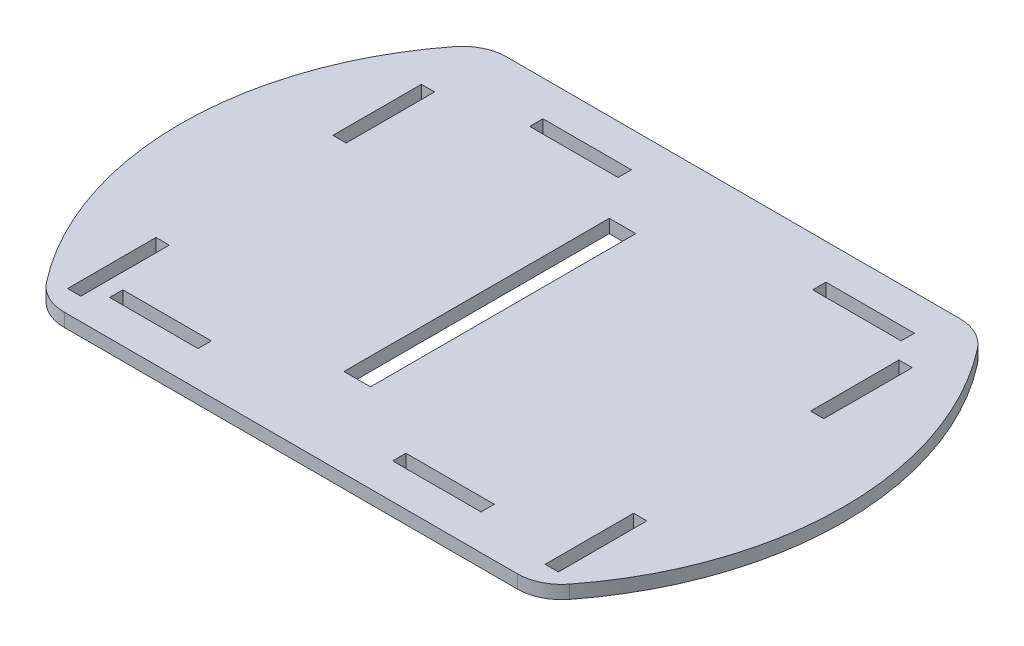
ISO-10303-21;
HEADER;
FILE_DESCRIPTION(('STEP AP214'),'2;1');
FILE_NAME('part.step','',(''),(''),'','','');
FILE_SCHEMA(('AUTOMOTIVE_DESIGN { 1 0 10303 214 1 1 1 1 }'));
ENDSEC;
DATA;
#1=APPLICATION_CONTEXT('core data for automotive mechanical design processes');
#2=APPLICATION_PROTOCOL_DEFINITION('international standard','automotive_design',2000,#1);
#3=PRODUCT_CONTEXT('',#1,'mechanical');
#4=PRODUCT('Part','Part','',(#3));
#5=PRODUCT_RELATED_PRODUCT_CATEGORY('part','',(#4));
#6=PRODUCT_DEFINITION_FORMATION('','',#4);
#7=PRODUCT_DEFINITION_CONTEXT('part definition',#1,'design');
#8=PRODUCT_DEFINITION('design','',#6,#7);
#9=PRODUCT_DEFINITION_SHAPE('','',#8);
#10=(LENGTH_UNIT() NAMED_UNIT(*) SI_UNIT(.MILLI.,.METRE.));
#11=(NAMED_UNIT(*) PLANE_ANGLE_UNIT() SI_UNIT($,.RADIAN.));
#12=(NAMED_UNIT(*) SI_UNIT($,.STERADIAN.) SOLID_ANGLE_UNIT());
#13=UNCERTAINTY_MEASURE_WITH_UNIT(LENGTH_MEASURE(1.E-05),#10,'distance_accuracy_value','');
#14=(GEOMETRIC_REPRESENTATION_CONTEXT(3) GLOBAL_UNCERTAINTY_ASSIGNED_CONTEXT((#13)) GLOBAL_UNIT_ASSIGNED_CONTEXT((#10,
#11,#12)) REPRESENTATION_CONTEXT('',''));
#15=CARTESIAN_POINT('',(0.,0.,0.));
#16=DIRECTION('',(0.,0.,1.));
#17=DIRECTION('',(1.,0.,0.));
#18=AXIS2_PLACEMENT_3D('',#15,#16,#17);
#19=CARTESIAN_POINT('',(0.,3.,0.));
#20=DIRECTION('',(0.,-1.,0.));
#21=DIRECTION('',(0.,0.,-1.));
#22=AXIS2_PLACEMENT_3D('',#19,#20,#21);
#23=CYLINDRICAL_SURFACE('',#22,75.);
#24=CARTESIAN_POINT('',(0.,3.,0.));
#25=DIRECTION('',(0.,1.,0.));
#26=DIRECTION('',(0.,0.,1.));
#27=AXIS2_PLACEMENT_3D('',#24,#25,#26);
#28=CIRCLE('',#27,75.);
#29=CARTESIAN_POINT('',(-59.1170236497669,3.,-46.1538461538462));
#30=VERTEX_POINT('',#29);
#31=CARTESIAN_POINT('',(-59.1170236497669,3.,46.1538461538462));
#32=VERTEX_POINT('',#31);
#33=EDGE_CURVE('E581',#30,#32,#28,.T.);
#34=ORIENTED_EDGE('',*,*,#33,.F.);
#35=DIRECTION('',(0.,-1.,0.));
#36=VECTOR('',#35,1.);
#37=CARTESIAN_POINT('',(-59.1170236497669,3.,-46.1538461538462));
#38=LINE('',#37,#36);
#39=CARTESIAN_POINT('',(-59.1170236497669,0.,-46.1538461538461));
#40=VERTEX_POINT('',#39);
#41=EDGE_CURVE('E634',#30,#40,#38,.T.);
#42=ORIENTED_EDGE('',*,*,#41,.T.);
#43=CARTESIAN_POINT('',(0.,0.,0.));
#44=DIRECTION('',(0.,1.,0.));
#45=DIRECTION('',(0.,0.,1.));
#46=AXIS2_PLACEMENT_3D('',#43,#44,#45);
#47=CIRCLE('',#46,75.);
#48=CARTESIAN_POINT('',(-59.1170236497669,0.,46.1538461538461));
#49=VERTEX_POINT('',#48);
#50=EDGE_CURVE('E572',#40,#49,#47,.T.);
#51=ORIENTED_EDGE('',*,*,#50,.T.);
#52=DIRECTION('',(0.,-1.,0.));
#53=VECTOR('',#52,1.);
#54=CARTESIAN_POINT('',(-59.1170236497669,3.,46.1538461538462));
#55=LINE('',#54,#53);
#56=EDGE_CURVE('E631',#49,#32,#55,.F.);
#57=ORIENTED_EDGE('',*,*,#56,.T.);
#58=EDGE_LOOP('',(#34,#42,#51,#57));
#59=FACE_BOUND('',#58,.T.);
#60=ADVANCED_FACE('F38',(#59),#23,.T.);
#61=CARTESIAN_POINT('',(0.,3.,0.));
#62=DIRECTION('',(0.,-1.,0.));
#63=DIRECTION('',(0.,0.,-1.));
#64=AXIS2_PLACEMENT_3D('',#61,#62,#63);
#65=CYLINDRICAL_SURFACE('',#64,75.);
#66=CARTESIAN_POINT('',(0.,0.,0.));
#67=DIRECTION('',(0.,1.,0.));
#68=DIRECTION('',(0.,0.,1.));
#69=AXIS2_PLACEMENT_3D('',#66,#67,#68);
#70=CIRCLE('',#69,75.);
#71=CARTESIAN_POINT('',(59.1170236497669,0.,46.1538461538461));
#72=VERTEX_POINT('',#71);
#73=CARTESIAN_POINT('',(59.1170236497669,0.,-46.1538461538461));
#74=VERTEX_POINT('',#73);
#75=EDGE_CURVE('E582',#72,#74,#70,.T.);
#76=ORIENTED_EDGE('',*,*,#75,.T.);
#77=DIRECTION('',(0.,-1.,0.));
#78=VECTOR('',#77,1.);
#79=CARTESIAN_POINT('',(59.1170236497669,3.,-46.1538461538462));
#80=LINE('',#79,#78);
#81=CARTESIAN_POINT('',(59.1170236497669,3.,-46.1538461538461));
#82=VERTEX_POINT('',#81);
#83=EDGE_CURVE('E658',#74,#82,#80,.F.);
#84=ORIENTED_EDGE('',*,*,#83,.T.);
#85=CARTESIAN_POINT('',(0.,3.,0.));
#86=DIRECTION('',(0.,1.,0.));
#87=DIRECTION('',(0.,0.,-1.));
#88=AXIS2_PLACEMENT_3D('',#85,#86,#87);
#89=CIRCLE('',#88,75.);
#90=CARTESIAN_POINT('',(59.1170236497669,3.,46.1538461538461));
#91=VERTEX_POINT('',#90);
#92=EDGE_CURVE('E579',#91,#82,#89,.T.);
#93=ORIENTED_EDGE('',*,*,#92,.F.);
#94=DIRECTION('',(0.,-1.,0.));
#95=VECTOR('',#94,1.);
#96=CARTESIAN_POINT('',(59.1170236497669,3.,46.1538461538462));
#97=LINE('',#96,#95);
#98=EDGE_CURVE('E655',#91,#72,#97,.T.);
#99=ORIENTED_EDGE('',*,*,#98,.T.);
#100=EDGE_LOOP('',(#76,#84,#93,#99));
#101=FACE_BOUND('',#100,.T.);
#102=ADVANCED_FACE('F685',(#101),#65,.T.);
#103=CARTESIAN_POINT('',(0.,3.,0.));
#104=DIRECTION('',(0.,-1.,0.));
#105=DIRECTION('',(0.,0.,-1.));
#106=AXIS2_PLACEMENT_3D('',#103,#104,#105);
#107=PLANE('',#106);
#108=DIRECTION('',(-1.,0.,0.));
#109=VECTOR('',#108,1.);
#110=CARTESIAN_POINT('',(-2.,3.,-30.));
#111=LINE('',#110,#109);
#112=CARTESIAN_POINT('',(-2.,3.,-30.));
#113=VERTEX_POINT('',#112);
#114=CARTESIAN_POINT('',(-8.,3.,-30.));
#115=VERTEX_POINT('',#114);
#116=EDGE_CURVE('E355',#113,#115,#111,.T.);
#117=ORIENTED_EDGE('',*,*,#116,.F.);
#118=DIRECTION('',(0.,0.,-1.));
#119=VECTOR('',#118,1.);
#120=CARTESIAN_POINT('',(-2.,3.,-30.));
#121=LINE('',#120,#119);
#122=CARTESIAN_POINT('',(-2.,3.,30.));
#123=VERTEX_POINT('',#122);
#124=EDGE_CURVE('E328',#123,#113,#121,.T.);
#125=ORIENTED_EDGE('',*,*,#124,.F.);
#126=DIRECTION('',(1.,0.,0.));
#127=VECTOR('',#126,1.);
#128=CARTESIAN_POINT('',(-2.,3.,30.));
#129=LINE('',#128,#127);
#130=CARTESIAN_POINT('',(-8.,3.,30.));
#131=VERTEX_POINT('',#130);
#132=EDGE_CURVE('E346',#131,#123,#129,.T.);
#133=ORIENTED_EDGE('',*,*,#132,.F.);
#134=DIRECTION('',(0.,0.,1.));
#135=VECTOR('',#134,1.);
#136=CARTESIAN_POINT('',(-8.,3.,-30.));
#137=LINE('',#136,#135);
#138=EDGE_CURVE('E349',#115,#131,#137,.T.);
#139=ORIENTED_EDGE('',*,*,#138,.F.);
#140=EDGE_LOOP('',(#117,#125,#133,#139));
#141=FACE_BOUND('',#140,.T.);
#142=DIRECTION('',(1.,0.,0.));
#143=VECTOR('',#142,1.);
#144=CARTESIAN_POINT('',(15.,3.,42.));
#145=LINE('',#144,#143);
#146=CARTESIAN_POINT('',(15.,3.,42.));
#147=VERTEX_POINT('',#146);
#148=CARTESIAN_POINT('',(35.,3.,42.));
#149=VERTEX_POINT('',#148);
#150=EDGE_CURVE('E419',#147,#149,#145,.T.);
#151=ORIENTED_EDGE('',*,*,#150,.F.);
#152=DIRECTION('',(0.,0.,1.));
#153=VECTOR('',#152,1.);
#154=CARTESIAN_POINT('',(15.,3.,39.));
#155=LINE('',#154,#153);
#156=CARTESIAN_POINT('',(15.,3.,39.));
#157=VERTEX_POINT('',#156);
#158=EDGE_CURVE('E417',#157,#147,#155,.T.);
#159=ORIENTED_EDGE('',*,*,#158,.F.);
#160=DIRECTION('',(-1.,0.,0.));
#161=VECTOR('',#160,1.);
#162=CARTESIAN_POINT('',(15.,3.,39.));
#163=LINE('',#162,#161);
#164=CARTESIAN_POINT('',(35.,3.,39.));
#165=VERTEX_POINT('',#164);
#166=EDGE_CURVE('E407',#165,#157,#163,.T.);
#167=ORIENTED_EDGE('',*,*,#166,.F.);
#168=DIRECTION('',(0.,0.,-1.));
#169=VECTOR('',#168,1.);
#170=CARTESIAN_POINT('',(35.,3.,39.));
#171=LINE('',#170,#169);
#172=EDGE_CURVE('E423',#149,#165,#171,.T.);
#173=ORIENTED_EDGE('',*,*,#172,.F.);
#174=EDGE_LOOP('',(#151,#159,#167,#173));
#175=FACE_BOUND('',#174,.T.);
#176=DIRECTION('',(1.,0.,0.));
#177=VECTOR('',#176,1.);
#178=CARTESIAN_POINT('',(-35.,3.,-39.));
#179=LINE('',#178,#177);
#180=CARTESIAN_POINT('',(-35.,3.,-39.));
#181=VERTEX_POINT('',#180);
#182=CARTESIAN_POINT('',(-15.,3.,-39.));
#183=VERTEX_POINT('',#182);
#184=EDGE_CURVE('E452',#181,#183,#179,.T.);
#185=ORIENTED_EDGE('',*,*,#184,.F.);
#186=DIRECTION('',(0.,0.,1.));
#187=VECTOR('',#186,1.);
#188=CARTESIAN_POINT('',(-35.,3.,-42.));
#189=LINE('',#188,#187);
#190=CARTESIAN_POINT('',(-35.,3.,-42.));
#191=VERTEX_POINT('',#190);
#192=EDGE_CURVE('E396',#191,#181,#189,.T.);
#193=ORIENTED_EDGE('',*,*,#192,.F.);
#194=DIRECTION('',(-1.,0.,0.));
#195=VECTOR('',#194,1.);
#196=CARTESIAN_POINT('',(-35.,3.,-42.));
#197=LINE('',#196,#195);
#198=CARTESIAN_POINT('',(-15.,3.,-42.));
#199=VERTEX_POINT('',#198);
#200=EDGE_CURVE('E441',#199,#191,#197,.T.);
#201=ORIENTED_EDGE('',*,*,#200,.F.);
#202=DIRECTION('',(0.,0.,-1.));
#203=VECTOR('',#202,1.);
#204=CARTESIAN_POINT('',(-15.,3.,-42.));
#205=LINE('',#204,#203);
#206=EDGE_CURVE('E455',#183,#199,#205,.T.);
#207=ORIENTED_EDGE('',*,*,#206,.F.);
#208=EDGE_LOOP('',(#185,#193,#201,#207));
#209=FACE_BOUND('',#208,.T.);
#210=DIRECTION('',(1.,0.,0.));
#211=VECTOR('',#210,1.);
#212=CARTESIAN_POINT('',(29.,3.,-39.));
#213=LINE('',#212,#211);
#214=CARTESIAN_POINT('',(29.,3.,-39.));
#215=VERTEX_POINT('',#214);
#216=CARTESIAN_POINT('',(49.,3.,-39.));
#217=VERTEX_POINT('',#216);
#218=EDGE_CURVE('E386',#215,#217,#213,.T.);
#219=ORIENTED_EDGE('',*,*,#218,.F.);
#220=DIRECTION('',(0.,0.,1.));
#221=VECTOR('',#220,1.);
#222=CARTESIAN_POINT('',(29.,3.,-42.));
#223=LINE('',#222,#221);
#224=CARTESIAN_POINT('',(29.,3.,-42.));
#225=VERTEX_POINT('',#224);
#226=EDGE_CURVE('E368',#225,#215,#223,.T.);
#227=ORIENTED_EDGE('',*,*,#226,.F.);
#228=DIRECTION('',(-1.,0.,0.));
#229=VECTOR('',#228,1.);
#230=CARTESIAN_POINT('',(29.,3.,-42.));
#231=LINE('',#230,#229);
#232=CARTESIAN_POINT('',(49.,3.,-42.));
#233=VERTEX_POINT('',#232);
#234=EDGE_CURVE('E375',#233,#225,#231,.T.);
#235=ORIENTED_EDGE('',*,*,#234,.F.);
#236=DIRECTION('',(0.,0.,-1.));
#237=VECTOR('',#236,1.);
#238=CARTESIAN_POINT('',(49.,3.,-42.));
#239=LINE('',#238,#237);
#240=EDGE_CURVE('E389',#217,#233,#239,.T.);
#241=ORIENTED_EDGE('',*,*,#240,.F.);
#242=EDGE_LOOP('',(#219,#227,#235,#241));
#243=FACE_BOUND('',#242,.T.);
#244=DIRECTION('',(1.,0.,0.));
#245=VECTOR('',#244,1.);
#246=CARTESIAN_POINT('',(-49.,3.,42.));
#247=LINE('',#246,#245);
#248=CARTESIAN_POINT('',(-49.,3.,42.));
#249=VERTEX_POINT('',#248);
#250=CARTESIAN_POINT('',(-29.,3.,42.));
#251=VERTEX_POINT('',#250);
#252=EDGE_CURVE('E482',#249,#251,#247,.T.);
#253=ORIENTED_EDGE('',*,*,#252,.F.);
#254=DIRECTION('',(0.,0.,1.));
#255=VECTOR('',#254,1.);
#256=CARTESIAN_POINT('',(-49.,3.,39.));
#257=LINE('',#256,#255);
#258=CARTESIAN_POINT('',(-49.,3.,39.));
#259=VERTEX_POINT('',#258);
#260=EDGE_CURVE('E430',#259,#249,#257,.T.);
#261=ORIENTED_EDGE('',*,*,#260,.F.);
#262=DIRECTION('',(-1.,0.,0.));
#263=VECTOR('',#262,1.);
#264=CARTESIAN_POINT('',(-49.,3.,39.));
#265=LINE('',#264,#263);
#266=CARTESIAN_POINT('',(-29.,3.,39.));
#267=VERTEX_POINT('',#266);
#268=EDGE_CURVE('E471',#267,#259,#265,.T.);
#269=ORIENTED_EDGE('',*,*,#268,.F.);
#270=DIRECTION('',(0.,0.,-1.));
#271=VECTOR('',#270,1.);
#272=CARTESIAN_POINT('',(-29.,3.,39.));
#273=LINE('',#272,#271);
#274=EDGE_CURVE('E485',#251,#267,#273,.T.);
#275=ORIENTED_EDGE('',*,*,#274,.F.);
#276=EDGE_LOOP('',(#253,#261,#269,#275));
#277=FACE_BOUND('',#276,.T.);
#278=DIRECTION('',(0.,0.,1.));
#279=VECTOR('',#278,1.);
#280=CARTESIAN_POINT('',(-55.5,3.,-35.));
#281=LINE('',#280,#279);
#282=CARTESIAN_POINT('',(-55.5,3.,-35.));
#283=VERTEX_POINT('',#282);
#284=CARTESIAN_POINT('',(-55.5,3.,-15.));
#285=VERTEX_POINT('',#284);
#286=EDGE_CURVE('E542',#283,#285,#281,.T.);
#287=ORIENTED_EDGE('',*,*,#286,.F.);
#288=DIRECTION('',(-1.,0.,0.));
#289=VECTOR('',#288,1.);
#290=CARTESIAN_POINT('',(-52.5,3.,-35.));
#291=LINE('',#290,#289);
#292=CARTESIAN_POINT('',(-52.5,3.,-35.));
#293=VERTEX_POINT('',#292);
#294=EDGE_CURVE('E492',#293,#283,#291,.T.);
#295=ORIENTED_EDGE('',*,*,#294,.F.);
#296=DIRECTION('',(0.,0.,-1.));
#297=VECTOR('',#296,1.);
#298=CARTESIAN_POINT('',(-52.5,3.,-35.));
#299=LINE('',#298,#297);
#300=CARTESIAN_POINT('',(-52.5,3.,-15.));
#301=VERTEX_POINT('',#300);
#302=EDGE_CURVE('E548',#301,#293,#299,.T.);
#303=ORIENTED_EDGE('',*,*,#302,.F.);
#304=DIRECTION('',(1.,0.,0.));
#305=VECTOR('',#304,1.);
#306=CARTESIAN_POINT('',(-52.5,3.,-15.));
#307=LINE('',#306,#305);
#308=EDGE_CURVE('E545',#285,#301,#307,.T.);
#309=ORIENTED_EDGE('',*,*,#308,.F.);
#310=EDGE_LOOP('',(#287,#295,#303,#309));
#311=FACE_BOUND('',#310,.T.);
#312=DIRECTION('',(0.,0.,1.));
#313=VECTOR('',#312,1.);
#314=CARTESIAN_POINT('',(-55.5,3.,25.));
#315=LINE('',#314,#313);
#316=CARTESIAN_POINT('',(-55.5,3.,25.));
#317=VERTEX_POINT('',#316);
#318=CARTESIAN_POINT('',(-55.5,3.,45.));
#319=VERTEX_POINT('',#318);
#320=EDGE_CURVE('E523',#317,#319,#315,.T.);
#321=ORIENTED_EDGE('',*,*,#320,.F.);
#322=DIRECTION('',(-1.,0.,0.));
#323=VECTOR('',#322,1.);
#324=CARTESIAN_POINT('',(-52.5,3.,25.));
#325=LINE('',#324,#323);
#326=CARTESIAN_POINT('',(-52.5,3.,25.));
#327=VERTEX_POINT('',#326);
#328=EDGE_CURVE('E521',#327,#317,#325,.T.);
#329=ORIENTED_EDGE('',*,*,#328,.F.);
#330=DIRECTION('',(0.,0.,-1.));
#331=VECTOR('',#330,1.);
#332=CARTESIAN_POINT('',(-52.5,3.,25.));
#333=LINE('',#332,#331);
#334=CARTESIAN_POINT('',(-52.5,3.,45.));
#335=VERTEX_POINT('',#334);
#336=EDGE_CURVE('E530',#335,#327,#333,.T.);
#337=ORIENTED_EDGE('',*,*,#336,.F.);
#338=DIRECTION('',(1.,0.,0.));
#339=VECTOR('',#338,1.);
#340=CARTESIAN_POINT('',(-52.5,3.,45.));
#341=LINE('',#340,#339);
#342=EDGE_CURVE('E527',#319,#335,#341,.T.);
#343=ORIENTED_EDGE('',*,*,#342,.F.);
#344=EDGE_LOOP('',(#321,#329,#337,#343));
#345=FACE_BOUND('',#344,.T.);
#346=DIRECTION('',(1.,0.,0.));
#347=VECTOR('',#346,1.);
#348=CARTESIAN_POINT('',(52.5,3.,45.));
#349=LINE('',#348,#347);
#350=CARTESIAN_POINT('',(52.5,3.,45.));
#351=VERTEX_POINT('',#350);
#352=CARTESIAN_POINT('',(55.5,3.,45.));
#353=VERTEX_POINT('',#352);
#354=EDGE_CURVE('E501',#351,#353,#349,.T.);
#355=ORIENTED_EDGE('',*,*,#354,.F.);
#356=DIRECTION('',(0.,0.,1.));
#357=VECTOR('',#356,1.);
#358=CARTESIAN_POINT('',(52.5,3.,25.));
#359=LINE('',#358,#357);
#360=CARTESIAN_POINT('',(52.5,3.,25.));
#361=VERTEX_POINT('',#360);
#362=EDGE_CURVE('E499',#361,#351,#359,.T.);
#363=ORIENTED_EDGE('',*,*,#362,.F.);
#364=DIRECTION('',(-1.,0.,0.));
#365=VECTOR('',#364,1.);
#366=CARTESIAN_POINT('',(52.5,3.,25.));
#367=LINE('',#366,#365);
#368=CARTESIAN_POINT('',(55.5,3.,25.));
#369=VERTEX_POINT('',#368);
#370=EDGE_CURVE('E508',#369,#361,#367,.T.);
#371=ORIENTED_EDGE('',*,*,#370,.F.);
#372=DIRECTION('',(0.,0.,-1.));
#373=VECTOR('',#372,1.);
#374=CARTESIAN_POINT('',(55.5,3.,25.));
#375=LINE('',#374,#373);
#376=EDGE_CURVE('E505',#353,#369,#375,.T.);
#377=ORIENTED_EDGE('',*,*,#376,.F.);
#378=EDGE_LOOP('',(#355,#363,#371,#377));
#379=FACE_BOUND('',#378,.T.);
#380=DIRECTION('',(1.,0.,0.));
#381=VECTOR('',#380,1.);
#382=CARTESIAN_POINT('',(52.5,3.,-15.));
#383=LINE('',#382,#381);
#384=CARTESIAN_POINT('',(52.5,3.,-15.));
#385=VERTEX_POINT('',#384);
#386=CARTESIAN_POINT('',(55.5,3.,-15.));
#387=VERTEX_POINT('',#386);
#388=EDGE_CURVE('E560',#385,#387,#383,.T.);
#389=ORIENTED_EDGE('',*,*,#388,.F.);
#390=DIRECTION('',(0.,0.,1.));
#391=VECTOR('',#390,1.);
#392=CARTESIAN_POINT('',(52.5,3.,-35.));
#393=LINE('',#392,#391);
#394=CARTESIAN_POINT('',(52.5,3.,-35.));
#395=VERTEX_POINT('',#394);
#396=EDGE_CURVE('E514',#395,#385,#393,.T.);
#397=ORIENTED_EDGE('',*,*,#396,.F.);
#398=DIRECTION('',(-1.,0.,0.));
#399=VECTOR('',#398,1.);
#400=CARTESIAN_POINT('',(52.5,3.,-35.));
#401=LINE('',#400,#399);
#402=CARTESIAN_POINT('',(55.5,3.,-35.));
#403=VERTEX_POINT('',#402);
#404=EDGE_CURVE('E566',#403,#395,#401,.T.);
#405=ORIENTED_EDGE('',*,*,#404,.F.);
#406=DIRECTION('',(0.,0.,-1.));
#407=VECTOR('',#406,1.);
#408=CARTESIAN_POINT('',(55.5,3.,-35.));
#409=LINE('',#408,#407);
#410=EDGE_CURVE('E563',#387,#403,#409,.T.);
#411=ORIENTED_EDGE('',*,*,#410,.F.);
#412=EDGE_LOOP('',(#389,#397,#405,#411));
#413=FACE_BOUND('',#412,.T.);
#414=DIRECTION('',(1.,0.,0.));
#415=VECTOR('',#414,1.);
#416=CARTESIAN_POINT('',(-59.7699074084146,3.,-50.));
#417=LINE('',#416,#415);
#418=CARTESIAN_POINT('',(-51.234753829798,3.,-50.));
#419=VERTEX_POINT('',#418);
#420=CARTESIAN_POINT('',(51.234753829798,3.,-50.));
#421=VERTEX_POINT('',#420);
#422=EDGE_CURVE('E361',#419,#421,#417,.T.);
#423=ORIENTED_EDGE('',*,*,#422,.F.);
#424=CARTESIAN_POINT('',(-51.234753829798,3.,-40.));
#425=DIRECTION('',(0.,-1.,0.));
#426=DIRECTION('',(0.,0.,-1.));
#427=AXIS2_PLACEMENT_3D('',#424,#425,#426);
#428=CIRCLE('',#427,10.);
#429=EDGE_CURVE('E653',#419,#30,#428,.F.);
#430=ORIENTED_EDGE('',*,*,#429,.T.);
#431=ORIENTED_EDGE('',*,*,#33,.T.);
#432=CARTESIAN_POINT('',(-51.234753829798,3.,40.));
#433=DIRECTION('',(0.,-1.,0.));
#434=DIRECTION('',(0.,0.,-1.));
#435=AXIS2_PLACEMENT_3D('',#432,#433,#434);
#436=CIRCLE('',#435,10.);
#437=CARTESIAN_POINT('',(-51.234753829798,3.,50.));
#438=VERTEX_POINT('',#437);
#439=EDGE_CURVE('E649',#32,#438,#436,.F.);
#440=ORIENTED_EDGE('',*,*,#439,.T.);
#441=DIRECTION('',(-1.,0.,0.));
#442=VECTOR('',#441,1.);
#443=CARTESIAN_POINT('',(-59.7699074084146,3.,50.));
#444=LINE('',#443,#442);
#445=CARTESIAN_POINT('',(51.234753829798,3.,50.));
#446=VERTEX_POINT('',#445);
#447=EDGE_CURVE('E365',#446,#438,#444,.T.);
#448=ORIENTED_EDGE('',*,*,#447,.F.);
#449=CARTESIAN_POINT('',(51.234753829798,3.,40.));
#450=DIRECTION('',(0.,-1.,0.));
#451=DIRECTION('',(0.,0.,-1.));
#452=AXIS2_PLACEMENT_3D('',#449,#450,#451);
#453=CIRCLE('',#452,10.);
#454=EDGE_CURVE('E61',#446,#91,#453,.F.);
#455=ORIENTED_EDGE('',*,*,#454,.T.);
#456=ORIENTED_EDGE('',*,*,#92,.T.);
#457=CARTESIAN_POINT('',(51.234753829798,3.,-40.));
#458=DIRECTION('',(0.,-1.,0.));
#459=DIRECTION('',(0.,0.,-1.));
#460=AXIS2_PLACEMENT_3D('',#457,#458,#459);
#461=CIRCLE('',#460,10.);
#462=EDGE_CURVE('E53',#82,#421,#461,.F.);
#463=ORIENTED_EDGE('',*,*,#462,.T.);
#464=EDGE_LOOP('',(#423,#430,#431,#440,#448,#455,#456,#463));
#465=FACE_BOUND('',#464,.T.);
#466=ADVANCED_FACE('F674',(#141,#175,#209,#243,#277,#311,#345,#379,#413,#465),#107,.F.);
#467=CARTESIAN_POINT('',(0.,0.,0.));
#468=DIRECTION('',(0.,-1.,0.));
#469=DIRECTION('',(0.,0.,-1.));
#470=AXIS2_PLACEMENT_3D('',#467,#468,#469);
#471=PLANE('',#470);
#472=DIRECTION('',(0.,0.,-1.));
#473=VECTOR('',#472,1.);
#474=CARTESIAN_POINT('',(-2.,0.,-30.));
#475=LINE('',#474,#473);
#476=CARTESIAN_POINT('',(-2.,0.,30.));
#477=VERTEX_POINT('',#476);
#478=CARTESIAN_POINT('',(-2.,0.,-30.));
#479=VERTEX_POINT('',#478);
#480=EDGE_CURVE('E325',#477,#479,#475,.T.);
#481=ORIENTED_EDGE('',*,*,#480,.T.);
#482=DIRECTION('',(-1.,0.,0.));
#483=VECTOR('',#482,1.);
#484=CARTESIAN_POINT('',(-2.,0.,-30.));
#485=LINE('',#484,#483);
#486=CARTESIAN_POINT('',(-8.,0.,-30.));
#487=VERTEX_POINT('',#486);
#488=EDGE_CURVE('E337',#479,#487,#485,.T.);
#489=ORIENTED_EDGE('',*,*,#488,.T.);
#490=DIRECTION('',(0.,0.,1.));
#491=VECTOR('',#490,1.);
#492=CARTESIAN_POINT('',(-8.,0.,-30.));
#493=LINE('',#492,#491);
#494=CARTESIAN_POINT('',(-8.,0.,30.));
#495=VERTEX_POINT('',#494);
#496=EDGE_CURVE('E341',#487,#495,#493,.T.);
#497=ORIENTED_EDGE('',*,*,#496,.T.);
#498=DIRECTION('',(1.,0.,0.));
#499=VECTOR('',#498,1.);
#500=CARTESIAN_POINT('',(-2.,0.,30.));
#501=LINE('',#500,#499);
#502=EDGE_CURVE('E333',#495,#477,#501,.T.);
#503=ORIENTED_EDGE('',*,*,#502,.T.);
#504=EDGE_LOOP('',(#481,#489,#497,#503));
#505=FACE_BOUND('',#504,.T.);
#506=ORIENTED_EDGE('',*,*,#50,.F.);
#507=CARTESIAN_POINT('',(-51.234753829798,0.,-40.));
#508=DIRECTION('',(0.,-1.,0.));
#509=DIRECTION('',(0.,0.,-1.));
#510=AXIS2_PLACEMENT_3D('',#507,#508,#509);
#511=CIRCLE('',#510,10.);
#512=CARTESIAN_POINT('',(-51.234753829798,0.,-50.));
#513=VERTEX_POINT('',#512);
#514=EDGE_CURVE('E643',#40,#513,#511,.T.);
#515=ORIENTED_EDGE('',*,*,#514,.T.);
#516=DIRECTION('',(-1.,0.,0.));
#517=VECTOR('',#516,1.);
#518=CARTESIAN_POINT('',(0.,0.,-50.));
#519=LINE('',#518,#517);
#520=CARTESIAN_POINT('',(51.234753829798,0.,-50.));
#521=VERTEX_POINT('',#520);
#522=EDGE_CURVE('E625',#521,#513,#519,.T.);
#523=ORIENTED_EDGE('',*,*,#522,.F.);
#524=CARTESIAN_POINT('',(51.234753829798,0.,-40.));
#525=DIRECTION('',(0.,-1.,0.));
#526=DIRECTION('',(0.,0.,-1.));
#527=AXIS2_PLACEMENT_3D('',#524,#525,#526);
#528=CIRCLE('',#527,10.);
#529=EDGE_CURVE('E641',#521,#74,#528,.T.);
#530=ORIENTED_EDGE('',*,*,#529,.T.);
#531=ORIENTED_EDGE('',*,*,#75,.F.);
#532=CARTESIAN_POINT('',(51.234753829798,0.,40.));
#533=DIRECTION('',(0.,-1.,0.));
#534=DIRECTION('',(0.,0.,-1.));
#535=AXIS2_PLACEMENT_3D('',#532,#533,#534);
#536=CIRCLE('',#535,10.);
#537=CARTESIAN_POINT('',(51.234753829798,0.,50.));
#538=VERTEX_POINT('',#537);
#539=EDGE_CURVE('E639',#72,#538,#536,.T.);
#540=ORIENTED_EDGE('',*,*,#539,.T.);
#541=DIRECTION('',(1.,0.,0.));
#542=VECTOR('',#541,1.);
#543=CARTESIAN_POINT('',(0.,0.,50.));
#544=LINE('',#543,#542);
#545=CARTESIAN_POINT('',(-51.234753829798,0.,50.));
#546=VERTEX_POINT('',#545);
#547=EDGE_CURVE('E628',#546,#538,#544,.T.);
#548=ORIENTED_EDGE('',*,*,#547,.F.);
#549=CARTESIAN_POINT('',(-51.234753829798,0.,40.));
#550=DIRECTION('',(0.,-1.,0.));
#551=DIRECTION('',(0.,0.,-1.));
#552=AXIS2_PLACEMENT_3D('',#549,#550,#551);
#553=CIRCLE('',#552,10.);
#554=EDGE_CURVE('E637',#546,#49,#553,.T.);
#555=ORIENTED_EDGE('',*,*,#554,.T.);
#556=EDGE_LOOP('',(#506,#515,#523,#530,#531,#540,#548,#555));
#557=FACE_BOUND('',#556,.T.);
#558=DIRECTION('',(0.,0.,1.));
#559=VECTOR('',#558,1.);
#560=CARTESIAN_POINT('',(15.,0.,39.));
#561=LINE('',#560,#559);
#562=CARTESIAN_POINT('',(15.,0.,39.));
#563=VERTEX_POINT('',#562);
#564=CARTESIAN_POINT('',(15.,0.,42.));
#565=VERTEX_POINT('',#564);
#566=EDGE_CURVE('E403',#563,#565,#561,.T.);
#567=ORIENTED_EDGE('',*,*,#566,.T.);
#568=DIRECTION('',(1.,0.,0.));
#569=VECTOR('',#568,1.);
#570=CARTESIAN_POINT('',(15.,0.,42.));
#571=LINE('',#570,#569);
#572=CARTESIAN_POINT('',(35.,0.,42.));
#573=VERTEX_POINT('',#572);
#574=EDGE_CURVE('E406',#565,#573,#571,.T.);
#575=ORIENTED_EDGE('',*,*,#574,.T.);
#576=DIRECTION('',(0.,0.,-1.));
#577=VECTOR('',#576,1.);
#578=CARTESIAN_POINT('',(35.,0.,39.));
#579=LINE('',#578,#577);
#580=CARTESIAN_POINT('',(35.,0.,39.));
#581=VERTEX_POINT('',#580);
#582=EDGE_CURVE('E410',#573,#581,#579,.T.);
#583=ORIENTED_EDGE('',*,*,#582,.T.);
#584=DIRECTION('',(-1.,0.,0.));
#585=VECTOR('',#584,1.);
#586=CARTESIAN_POINT('',(15.,0.,39.));
#587=LINE('',#586,#585);
#588=EDGE_CURVE('E413',#581,#563,#587,.T.);
#589=ORIENTED_EDGE('',*,*,#588,.T.);
#590=EDGE_LOOP('',(#567,#575,#583,#589));
#591=FACE_BOUND('',#590,.T.);
#592=DIRECTION('',(0.,0.,1.));
#593=VECTOR('',#592,1.);
#594=CARTESIAN_POINT('',(-35.,0.,-42.));
#595=LINE('',#594,#593);
#596=CARTESIAN_POINT('',(-35.,0.,-42.));
#597=VERTEX_POINT('',#596);
#598=CARTESIAN_POINT('',(-35.,0.,-39.));
#599=VERTEX_POINT('',#598);
#600=EDGE_CURVE('E437',#597,#599,#595,.T.);
#601=ORIENTED_EDGE('',*,*,#600,.T.);
#602=DIRECTION('',(1.,0.,0.));
#603=VECTOR('',#602,1.);
#604=CARTESIAN_POINT('',(-35.,0.,-39.));
#605=LINE('',#604,#603);
#606=CARTESIAN_POINT('',(-15.,0.,-39.));
#607=VERTEX_POINT('',#606);
#608=EDGE_CURVE('E440',#599,#607,#605,.T.);
#609=ORIENTED_EDGE('',*,*,#608,.T.);
#610=DIRECTION('',(0.,0.,-1.));
#611=VECTOR('',#610,1.);
#612=CARTESIAN_POINT('',(-15.,0.,-42.));
#613=LINE('',#612,#611);
#614=CARTESIAN_POINT('',(-15.,0.,-42.));
#615=VERTEX_POINT('',#614);
#616=EDGE_CURVE('E444',#607,#615,#613,.T.);
#617=ORIENTED_EDGE('',*,*,#616,.T.);
#618=DIRECTION('',(-1.,0.,0.));
#619=VECTOR('',#618,1.);
#620=CARTESIAN_POINT('',(-35.,0.,-42.));
#621=LINE('',#620,#619);
#622=EDGE_CURVE('E447',#615,#597,#621,.T.);
#623=ORIENTED_EDGE('',*,*,#622,.T.);
#624=EDGE_LOOP('',(#601,#609,#617,#623));
#625=FACE_BOUND('',#624,.T.);
#626=DIRECTION('',(0.,0.,1.));
#627=VECTOR('',#626,1.);
#628=CARTESIAN_POINT('',(29.,0.,-42.));
#629=LINE('',#628,#627);
#630=CARTESIAN_POINT('',(29.,0.,-42.));
#631=VERTEX_POINT('',#630);
#632=CARTESIAN_POINT('',(29.,0.,-39.));
#633=VERTEX_POINT('',#632);
#634=EDGE_CURVE('E371',#631,#633,#629,.T.);
#635=ORIENTED_EDGE('',*,*,#634,.T.);
#636=DIRECTION('',(1.,0.,0.));
#637=VECTOR('',#636,1.);
#638=CARTESIAN_POINT('',(29.,0.,-39.));
#639=LINE('',#638,#637);
#640=CARTESIAN_POINT('',(49.,0.,-39.));
#641=VERTEX_POINT('',#640);
#642=EDGE_CURVE('E374',#633,#641,#639,.T.);
#643=ORIENTED_EDGE('',*,*,#642,.T.);
#644=DIRECTION('',(0.,0.,-1.));
#645=VECTOR('',#644,1.);
#646=CARTESIAN_POINT('',(49.,0.,-42.));
#647=LINE('',#646,#645);
#648=CARTESIAN_POINT('',(49.,0.,-42.));
#649=VERTEX_POINT('',#648);
#650=EDGE_CURVE('E378',#641,#649,#647,.T.);
#651=ORIENTED_EDGE('',*,*,#650,.T.);
#652=DIRECTION('',(-1.,0.,0.));
#653=VECTOR('',#652,1.);
#654=CARTESIAN_POINT('',(29.,0.,-42.));
#655=LINE('',#654,#653);
#656=EDGE_CURVE('E381',#649,#631,#655,.T.);
#657=ORIENTED_EDGE('',*,*,#656,.T.);
#658=EDGE_LOOP('',(#635,#643,#651,#657));
#659=FACE_BOUND('',#658,.T.);
#660=DIRECTION('',(0.,0.,1.));
#661=VECTOR('',#660,1.);
#662=CARTESIAN_POINT('',(-49.,0.,39.));
#663=LINE('',#662,#661);
#664=CARTESIAN_POINT('',(-49.,0.,39.));
#665=VERTEX_POINT('',#664);
#666=CARTESIAN_POINT('',(-49.,0.,42.));
#667=VERTEX_POINT('',#666);
#668=EDGE_CURVE('E467',#665,#667,#663,.T.);
#669=ORIENTED_EDGE('',*,*,#668,.T.);
#670=DIRECTION('',(1.,0.,0.));
#671=VECTOR('',#670,1.);
#672=CARTESIAN_POINT('',(-49.,0.,42.));
#673=LINE('',#672,#671);
#674=CARTESIAN_POINT('',(-29.,0.,42.));
#675=VERTEX_POINT('',#674);
#676=EDGE_CURVE('E470',#667,#675,#673,.T.);
#677=ORIENTED_EDGE('',*,*,#676,.T.);
#678=DIRECTION('',(0.,0.,-1.));
#679=VECTOR('',#678,1.);
#680=CARTESIAN_POINT('',(-29.,0.,39.));
#681=LINE('',#680,#679);
#682=CARTESIAN_POINT('',(-29.,0.,39.));
#683=VERTEX_POINT('',#682);
#684=EDGE_CURVE('E474',#675,#683,#681,.T.);
#685=ORIENTED_EDGE('',*,*,#684,.T.);
#686=DIRECTION('',(-1.,0.,0.));
#687=VECTOR('',#686,1.);
#688=CARTESIAN_POINT('',(-49.,0.,39.));
#689=LINE('',#688,#687);
#690=EDGE_CURVE('E477',#683,#665,#689,.T.);
#691=ORIENTED_EDGE('',*,*,#690,.T.);
#692=EDGE_LOOP('',(#669,#677,#685,#691));
#693=FACE_BOUND('',#692,.T.);
#694=DIRECTION('',(1.,0.,0.));
#695=VECTOR('',#694,1.);
#696=CARTESIAN_POINT('',(0.,0.,-35.));
#697=LINE('',#696,#695);
#698=CARTESIAN_POINT('',(-55.5,0.,-35.));
#699=VERTEX_POINT('',#698);
#700=CARTESIAN_POINT('',(-52.5,0.,-35.));
#701=VERTEX_POINT('',#700);
#702=EDGE_CURVE('E623',#699,#701,#697,.T.);
#703=ORIENTED_EDGE('',*,*,#702,.F.);
#704=DIRECTION('',(0.,0.,-1.));
#705=VECTOR('',#704,1.);
#706=CARTESIAN_POINT('',(-55.5,0.,0.));
#707=LINE('',#706,#705);
#708=CARTESIAN_POINT('',(-55.5,0.,-15.));
#709=VERTEX_POINT('',#708);
#710=EDGE_CURVE('E616',#709,#699,#707,.T.);
#711=ORIENTED_EDGE('',*,*,#710,.F.);
#712=DIRECTION('',(-1.,0.,0.));
#713=VECTOR('',#712,1.);
#714=CARTESIAN_POINT('',(0.,0.,-15.));
#715=LINE('',#714,#713);
#716=CARTESIAN_POINT('',(-52.5,0.,-15.));
#717=VERTEX_POINT('',#716);
#718=EDGE_CURVE('E618',#717,#709,#715,.T.);
#719=ORIENTED_EDGE('',*,*,#718,.F.);
#720=DIRECTION('',(0.,0.,1.));
#721=VECTOR('',#720,1.);
#722=CARTESIAN_POINT('',(-52.5,0.,0.));
#723=LINE('',#722,#721);
#724=EDGE_CURVE('E621',#701,#717,#723,.T.);
#725=ORIENTED_EDGE('',*,*,#724,.F.);
#726=EDGE_LOOP('',(#703,#711,#719,#725));
#727=FACE_BOUND('',#726,.T.);
#728=DIRECTION('',(1.,0.,0.));
#729=VECTOR('',#728,1.);
#730=CARTESIAN_POINT('',(0.,0.,25.));
#731=LINE('',#730,#729);
#732=CARTESIAN_POINT('',(-55.5,0.,25.));
#733=VERTEX_POINT('',#732);
#734=CARTESIAN_POINT('',(-52.5,0.,25.));
#735=VERTEX_POINT('',#734);
#736=EDGE_CURVE('E614',#733,#735,#731,.T.);
#737=ORIENTED_EDGE('',*,*,#736,.F.);
#738=DIRECTION('',(0.,0.,-1.));
#739=VECTOR('',#738,1.);
#740=CARTESIAN_POINT('',(-55.5,0.,0.));
#741=LINE('',#740,#739);
#742=CARTESIAN_POINT('',(-55.5,0.,45.));
#743=VERTEX_POINT('',#742);
#744=EDGE_CURVE('E607',#743,#733,#741,.T.);
#745=ORIENTED_EDGE('',*,*,#744,.F.);
#746=DIRECTION('',(-1.,0.,0.));
#747=VECTOR('',#746,1.);
#748=CARTESIAN_POINT('',(0.,0.,45.));
#749=LINE('',#748,#747);
#750=CARTESIAN_POINT('',(-52.5,0.,45.));
#751=VERTEX_POINT('',#750);
#752=EDGE_CURVE('E609',#751,#743,#749,.T.);
#753=ORIENTED_EDGE('',*,*,#752,.F.);
#754=DIRECTION('',(0.,0.,1.));
#755=VECTOR('',#754,1.);
#756=CARTESIAN_POINT('',(-52.5,0.,0.));
#757=LINE('',#756,#755);
#758=EDGE_CURVE('E612',#735,#751,#757,.T.);
#759=ORIENTED_EDGE('',*,*,#758,.F.);
#760=EDGE_LOOP('',(#737,#745,#753,#759));
#761=FACE_BOUND('',#760,.T.);
#762=DIRECTION('',(0.,0.,-1.));
#763=VECTOR('',#762,1.);
#764=CARTESIAN_POINT('',(52.5,0.,0.));
#765=LINE('',#764,#763);
#766=CARTESIAN_POINT('',(52.5,0.,45.));
#767=VERTEX_POINT('',#766);
#768=CARTESIAN_POINT('',(52.5,0.,25.));
#769=VERTEX_POINT('',#768);
#770=EDGE_CURVE('E605',#767,#769,#765,.T.);
#771=ORIENTED_EDGE('',*,*,#770,.F.);
#772=DIRECTION('',(-1.,0.,0.));
#773=VECTOR('',#772,1.);
#774=CARTESIAN_POINT('',(0.,0.,45.));
#775=LINE('',#774,#773);
#776=CARTESIAN_POINT('',(55.5,0.,45.));
#777=VERTEX_POINT('',#776);
#778=EDGE_CURVE('E598',#777,#767,#775,.T.);
#779=ORIENTED_EDGE('',*,*,#778,.F.);
#780=DIRECTION('',(0.,0.,1.));
#781=VECTOR('',#780,1.);
#782=CARTESIAN_POINT('',(55.5,0.,0.));
#783=LINE('',#782,#781);
#784=CARTESIAN_POINT('',(55.5,0.,25.));
#785=VERTEX_POINT('',#784);
#786=EDGE_CURVE('E600',#785,#777,#783,.T.);
#787=ORIENTED_EDGE('',*,*,#786,.F.);
#788=DIRECTION('',(1.,0.,0.));
#789=VECTOR('',#788,1.);
#790=CARTESIAN_POINT('',(0.,0.,25.));
#791=LINE('',#790,#789);
#792=EDGE_CURVE('E603',#769,#785,#791,.T.);
#793=ORIENTED_EDGE('',*,*,#792,.F.);
#794=EDGE_LOOP('',(#771,#779,#787,#793));
#795=FACE_BOUND('',#794,.T.);
#796=DIRECTION('',(0.,0.,-1.));
#797=VECTOR('',#796,1.);
#798=CARTESIAN_POINT('',(52.5,0.,0.));
#799=LINE('',#798,#797);
#800=CARTESIAN_POINT('',(52.5,0.,-15.));
#801=VERTEX_POINT('',#800);
#802=CARTESIAN_POINT('',(52.5,0.,-35.));
#803=VERTEX_POINT('',#802);
#804=EDGE_CURVE('E596',#801,#803,#799,.T.);
#805=ORIENTED_EDGE('',*,*,#804,.F.);
#806=DIRECTION('',(-1.,0.,0.));
#807=VECTOR('',#806,1.);
#808=CARTESIAN_POINT('',(0.,0.,-15.));
#809=LINE('',#808,#807);
#810=CARTESIAN_POINT('',(55.5,0.,-15.));
#811=VERTEX_POINT('',#810);
#812=EDGE_CURVE('E585',#811,#801,#809,.T.);
#813=ORIENTED_EDGE('',*,*,#812,.F.);
#814=DIRECTION('',(0.,0.,1.));
#815=VECTOR('',#814,1.);
#816=CARTESIAN_POINT('',(55.5,0.,0.));
#817=LINE('',#816,#815);
#818=CARTESIAN_POINT('',(55.5,0.,-35.));
#819=VERTEX_POINT('',#818);
#820=EDGE_CURVE('E591',#819,#811,#817,.T.);
#821=ORIENTED_EDGE('',*,*,#820,.F.);
#822=DIRECTION('',(1.,0.,0.));
#823=VECTOR('',#822,1.);
#824=CARTESIAN_POINT('',(0.,0.,-35.));
#825=LINE('',#824,#823);
#826=EDGE_CURVE('E594',#803,#819,#825,.T.);
#827=ORIENTED_EDGE('',*,*,#826,.F.);
#828=EDGE_LOOP('',(#805,#813,#821,#827));
#829=FACE_BOUND('',#828,.T.);
#830=ADVANCED_FACE('F343',(#505,#557,#591,#625,#659,#693,#727,#761,#795,#829),#471,.T.);
#831=CARTESIAN_POINT('',(52.5,-7.,-35.));
#832=DIRECTION('',(-1.,0.,0.));
#833=DIRECTION('',(0.,0.,1.));
#834=AXIS2_PLACEMENT_3D('',#831,#832,#833);
#835=PLANE('',#834);
#836=ORIENTED_EDGE('',*,*,#804,.T.);
#837=DIRECTION('',(0.,1.,0.));
#838=VECTOR('',#837,1.);
#839=CARTESIAN_POINT('',(52.5,-7.,-35.));
#840=LINE('',#839,#838);
#841=EDGE_CURVE('E570',#803,#395,#840,.T.);
#842=ORIENTED_EDGE('',*,*,#841,.T.);
#843=ORIENTED_EDGE('',*,*,#396,.T.);
#844=DIRECTION('',(0.,1.,0.));
#845=VECTOR('',#844,1.);
#846=CARTESIAN_POINT('',(52.5,-7.,-15.));
#847=LINE('',#846,#845);
#848=EDGE_CURVE('E569',#801,#385,#847,.T.);
#849=ORIENTED_EDGE('',*,*,#848,.F.);
#850=EDGE_LOOP('',(#836,#842,#843,#849));
#851=FACE_BOUND('',#850,.T.);
#852=ADVANCED_FACE('F840',(#851),#835,.F.);
#853=CARTESIAN_POINT('',(52.5,-7.,-35.));
#854=DIRECTION('',(0.,0.,-1.));
#855=DIRECTION('',(-1.,0.,0.));
#856=AXIS2_PLACEMENT_3D('',#853,#854,#855);
#857=PLANE('',#856);
#858=ORIENTED_EDGE('',*,*,#826,.T.);
#859=DIRECTION('',(0.,1.,0.));
#860=VECTOR('',#859,1.);
#861=CARTESIAN_POINT('',(55.5,-7.,-35.));
#862=LINE('',#861,#860);
#863=EDGE_CURVE('E573',#819,#403,#862,.T.);
#864=ORIENTED_EDGE('',*,*,#863,.T.);
#865=ORIENTED_EDGE('',*,*,#404,.T.);
#866=ORIENTED_EDGE('',*,*,#841,.F.);
#867=EDGE_LOOP('',(#858,#864,#865,#866));
#868=FACE_BOUND('',#867,.T.);
#869=ADVANCED_FACE('F836',(#868),#857,.F.);
#870=CARTESIAN_POINT('',(55.5,-7.,-35.));
#871=DIRECTION('',(1.,0.,0.));
#872=DIRECTION('',(0.,0.,-1.));
#873=AXIS2_PLACEMENT_3D('',#870,#871,#872);
#874=PLANE('',#873);
#875=ORIENTED_EDGE('',*,*,#820,.T.);
#876=DIRECTION('',(0.,1.,0.));
#877=VECTOR('',#876,1.);
#878=CARTESIAN_POINT('',(55.5,-7.,-15.));
#879=LINE('',#878,#877);
#880=EDGE_CURVE('E575',#811,#387,#879,.T.);
#881=ORIENTED_EDGE('',*,*,#880,.T.);
#882=ORIENTED_EDGE('',*,*,#410,.T.);
#883=ORIENTED_EDGE('',*,*,#863,.F.);
#884=EDGE_LOOP('',(#875,#881,#882,#883));
#885=FACE_BOUND('',#884,.T.);
#886=ADVANCED_FACE('F839',(#885),#874,.F.);
#887=CARTESIAN_POINT('',(52.5,-7.,-15.));
#888=DIRECTION('',(0.,0.,1.));
#889=DIRECTION('',(1.,0.,0.));
#890=AXIS2_PLACEMENT_3D('',#887,#888,#889);
#891=PLANE('',#890);
#892=ORIENTED_EDGE('',*,*,#812,.T.);
#893=ORIENTED_EDGE('',*,*,#848,.T.);
#894=ORIENTED_EDGE('',*,*,#388,.T.);
#895=ORIENTED_EDGE('',*,*,#880,.F.);
#896=EDGE_LOOP('',(#892,#893,#894,#895));
#897=FACE_BOUND('',#896,.T.);
#898=ADVANCED_FACE('F804',(#897),#891,.F.);
#899=CARTESIAN_POINT('',(52.5,-7.,25.));
#900=DIRECTION('',(-1.,0.,0.));
#901=DIRECTION('',(0.,0.,1.));
#902=AXIS2_PLACEMENT_3D('',#899,#900,#901);
#903=PLANE('',#902);
#904=ORIENTED_EDGE('',*,*,#770,.T.);
#905=DIRECTION('',(0.,1.,0.));
#906=VECTOR('',#905,1.);
#907=CARTESIAN_POINT('',(52.5,-7.,25.));
#908=LINE('',#907,#906);
#909=EDGE_CURVE('E512',#769,#361,#908,.T.);
#910=ORIENTED_EDGE('',*,*,#909,.T.);
#911=ORIENTED_EDGE('',*,*,#362,.T.);
#912=DIRECTION('',(0.,1.,0.));
#913=VECTOR('',#912,1.);
#914=CARTESIAN_POINT('',(52.5,-7.,45.));
#915=LINE('',#914,#913);
#916=EDGE_CURVE('E511',#767,#351,#915,.T.);
#917=ORIENTED_EDGE('',*,*,#916,.F.);
#918=EDGE_LOOP('',(#904,#910,#911,#917));
#919=FACE_BOUND('',#918,.T.);
#920=ADVANCED_FACE('F792',(#919),#903,.F.);
#921=CARTESIAN_POINT('',(52.5,-7.,25.));
#922=DIRECTION('',(0.,0.,-1.));
#923=DIRECTION('',(-1.,0.,0.));
#924=AXIS2_PLACEMENT_3D('',#921,#922,#923);
#925=PLANE('',#924);
#926=ORIENTED_EDGE('',*,*,#792,.T.);
#927=DIRECTION('',(0.,1.,0.));
#928=VECTOR('',#927,1.);
#929=CARTESIAN_POINT('',(55.5,-7.,25.));
#930=LINE('',#929,#928);
#931=EDGE_CURVE('E515',#785,#369,#930,.T.);
#932=ORIENTED_EDGE('',*,*,#931,.T.);
#933=ORIENTED_EDGE('',*,*,#370,.T.);
#934=ORIENTED_EDGE('',*,*,#909,.F.);
#935=EDGE_LOOP('',(#926,#932,#933,#934));
#936=FACE_BOUND('',#935,.T.);
#937=ADVANCED_FACE('F788',(#936),#925,.F.);
#938=CARTESIAN_POINT('',(55.5,-7.,25.));
#939=DIRECTION('',(1.,0.,0.));
#940=DIRECTION('',(0.,0.,-1.));
#941=AXIS2_PLACEMENT_3D('',#938,#939,#940);
#942=PLANE('',#941);
#943=ORIENTED_EDGE('',*,*,#786,.T.);
#944=DIRECTION('',(0.,1.,0.));
#945=VECTOR('',#944,1.);
#946=CARTESIAN_POINT('',(55.5,-7.,45.));
#947=LINE('',#946,#945);
#948=EDGE_CURVE('E517',#777,#353,#947,.T.);
#949=ORIENTED_EDGE('',*,*,#948,.T.);
#950=ORIENTED_EDGE('',*,*,#376,.T.);
#951=ORIENTED_EDGE('',*,*,#931,.F.);
#952=EDGE_LOOP('',(#943,#949,#950,#951));
#953=FACE_BOUND('',#952,.T.);
#954=ADVANCED_FACE('F791',(#953),#942,.F.);
#955=CARTESIAN_POINT('',(52.5,-7.,45.));
#956=DIRECTION('',(0.,0.,1.));
#957=DIRECTION('',(1.,0.,0.));
#958=AXIS2_PLACEMENT_3D('',#955,#956,#957);
#959=PLANE('',#958);
#960=ORIENTED_EDGE('',*,*,#778,.T.);
#961=ORIENTED_EDGE('',*,*,#916,.T.);
#962=ORIENTED_EDGE('',*,*,#354,.T.);
#963=ORIENTED_EDGE('',*,*,#948,.F.);
#964=EDGE_LOOP('',(#960,#961,#962,#963));
#965=FACE_BOUND('',#964,.T.);
#966=ADVANCED_FACE('F796',(#965),#959,.F.);
#967=CARTESIAN_POINT('',(-52.5,-7.,25.));
#968=DIRECTION('',(0.,0.,-1.));
#969=DIRECTION('',(-1.,0.,0.));
#970=AXIS2_PLACEMENT_3D('',#967,#968,#969);
#971=PLANE('',#970);
#972=ORIENTED_EDGE('',*,*,#736,.T.);
#973=DIRECTION('',(0.,1.,0.));
#974=VECTOR('',#973,1.);
#975=CARTESIAN_POINT('',(-52.5,-7.,25.));
#976=LINE('',#975,#974);
#977=EDGE_CURVE('E502',#735,#327,#976,.T.);
#978=ORIENTED_EDGE('',*,*,#977,.T.);
#979=ORIENTED_EDGE('',*,*,#328,.T.);
#980=DIRECTION('',(0.,1.,0.));
#981=VECTOR('',#980,1.);
#982=CARTESIAN_POINT('',(-55.5,-7.,25.));
#983=LINE('',#982,#981);
#984=EDGE_CURVE('E533',#733,#317,#983,.T.);
#985=ORIENTED_EDGE('',*,*,#984,.F.);
#986=EDGE_LOOP('',(#972,#978,#979,#985));
#987=FACE_BOUND('',#986,.T.);
#988=ADVANCED_FACE('F800',(#987),#971,.F.);
#989=CARTESIAN_POINT('',(-52.5,-7.,25.));
#990=DIRECTION('',(1.,0.,0.));
#991=DIRECTION('',(0.,0.,-1.));
#992=AXIS2_PLACEMENT_3D('',#989,#990,#991);
#993=PLANE('',#992);
#994=ORIENTED_EDGE('',*,*,#758,.T.);
#995=DIRECTION('',(0.,1.,0.));
#996=VECTOR('',#995,1.);
#997=CARTESIAN_POINT('',(-52.5,-7.,45.));
#998=LINE('',#997,#996);
#999=EDGE_CURVE('E535',#751,#335,#998,.T.);
#1000=ORIENTED_EDGE('',*,*,#999,.T.);
#1001=ORIENTED_EDGE('',*,*,#336,.T.);
#1002=ORIENTED_EDGE('',*,*,#977,.F.);
#1003=EDGE_LOOP('',(#994,#1000,#1001,#1002));
#1004=FACE_BOUND('',#1003,.T.);
#1005=ADVANCED_FACE('F806',(#1004),#993,.F.);
#1006=CARTESIAN_POINT('',(-52.5,-7.,45.));
#1007=DIRECTION('',(0.,0.,1.));
#1008=DIRECTION('',(1.,0.,0.));
#1009=AXIS2_PLACEMENT_3D('',#1006,#1007,#1008);
#1010=PLANE('',#1009);
#1011=ORIENTED_EDGE('',*,*,#752,.T.);
#1012=DIRECTION('',(0.,1.,0.));
#1013=VECTOR('',#1012,1.);
#1014=CARTESIAN_POINT('',(-55.5,-7.,45.));
#1015=LINE('',#1014,#1013);
#1016=EDGE_CURVE('E537',#743,#319,#1015,.T.);
#1017=ORIENTED_EDGE('',*,*,#1016,.T.);
#1018=ORIENTED_EDGE('',*,*,#342,.T.);
#1019=ORIENTED_EDGE('',*,*,#999,.F.);
#1020=EDGE_LOOP('',(#1011,#1017,#1018,#1019));
#1021=FACE_BOUND('',#1020,.T.);
#1022=ADVANCED_FACE('F809',(#1021),#1010,.F.);
#1023=CARTESIAN_POINT('',(-55.5,-7.,25.));
#1024=DIRECTION('',(-1.,0.,0.));
#1025=DIRECTION('',(0.,0.,1.));
#1026=AXIS2_PLACEMENT_3D('',#1023,#1024,#1025);
#1027=PLANE('',#1026);
#1028=ORIENTED_EDGE('',*,*,#744,.T.);
#1029=ORIENTED_EDGE('',*,*,#984,.T.);
#1030=ORIENTED_EDGE('',*,*,#320,.T.);
#1031=ORIENTED_EDGE('',*,*,#1016,.F.);
#1032=EDGE_LOOP('',(#1028,#1029,#1030,#1031));
#1033=FACE_BOUND('',#1032,.T.);
#1034=ADVANCED_FACE('F813',(#1033),#1027,.F.);
#1035=CARTESIAN_POINT('',(-52.5,-7.,-35.));
#1036=DIRECTION('',(0.,0.,-1.));
#1037=DIRECTION('',(-1.,0.,0.));
#1038=AXIS2_PLACEMENT_3D('',#1035,#1036,#1037);
#1039=PLANE('',#1038);
#1040=ORIENTED_EDGE('',*,*,#702,.T.);
#1041=DIRECTION('',(0.,1.,0.));
#1042=VECTOR('',#1041,1.);
#1043=CARTESIAN_POINT('',(-52.5,-7.,-35.));
#1044=LINE('',#1043,#1042);
#1045=EDGE_CURVE('E524',#701,#293,#1044,.T.);
#1046=ORIENTED_EDGE('',*,*,#1045,.T.);
#1047=ORIENTED_EDGE('',*,*,#294,.T.);
#1048=DIRECTION('',(0.,1.,0.));
#1049=VECTOR('',#1048,1.);
#1050=CARTESIAN_POINT('',(-55.5,-7.,-35.));
#1051=LINE('',#1050,#1049);
#1052=EDGE_CURVE('E551',#699,#283,#1051,.T.);
#1053=ORIENTED_EDGE('',*,*,#1052,.F.);
#1054=EDGE_LOOP('',(#1040,#1046,#1047,#1053));
#1055=FACE_BOUND('',#1054,.T.);
#1056=ADVANCED_FACE('F817',(#1055),#1039,.F.);
#1057=CARTESIAN_POINT('',(-52.5,-7.,-35.));
#1058=DIRECTION('',(1.,0.,0.));
#1059=DIRECTION('',(0.,0.,-1.));
#1060=AXIS2_PLACEMENT_3D('',#1057,#1058,#1059);
#1061=PLANE('',#1060);
#1062=ORIENTED_EDGE('',*,*,#724,.T.);
#1063=DIRECTION('',(0.,1.,0.));
#1064=VECTOR('',#1063,1.);
#1065=CARTESIAN_POINT('',(-52.5,-7.,-15.));
#1066=LINE('',#1065,#1064);
#1067=EDGE_CURVE('E553',#717,#301,#1066,.T.);
#1068=ORIENTED_EDGE('',*,*,#1067,.T.);
#1069=ORIENTED_EDGE('',*,*,#302,.T.);
#1070=ORIENTED_EDGE('',*,*,#1045,.F.);
#1071=EDGE_LOOP('',(#1062,#1068,#1069,#1070));
#1072=FACE_BOUND('',#1071,.T.);
#1073=ADVANCED_FACE('F822',(#1072),#1061,.F.);
#1074=CARTESIAN_POINT('',(-52.5,-7.,-15.));
#1075=DIRECTION('',(0.,0.,1.));
#1076=DIRECTION('',(1.,0.,0.));
#1077=AXIS2_PLACEMENT_3D('',#1074,#1075,#1076);
#1078=PLANE('',#1077);
#1079=ORIENTED_EDGE('',*,*,#718,.T.);
#1080=DIRECTION('',(0.,1.,0.));
#1081=VECTOR('',#1080,1.);
#1082=CARTESIAN_POINT('',(-55.5,-7.,-15.));
#1083=LINE('',#1082,#1081);
#1084=EDGE_CURVE('E555',#709,#285,#1083,.T.);
#1085=ORIENTED_EDGE('',*,*,#1084,.T.);
#1086=ORIENTED_EDGE('',*,*,#308,.T.);
#1087=ORIENTED_EDGE('',*,*,#1067,.F.);
#1088=EDGE_LOOP('',(#1079,#1085,#1086,#1087));
#1089=FACE_BOUND('',#1088,.T.);
#1090=ADVANCED_FACE('F825',(#1089),#1078,.F.);
#1091=CARTESIAN_POINT('',(-55.5,-7.,-35.));
#1092=DIRECTION('',(-1.,0.,0.));
#1093=DIRECTION('',(0.,0.,1.));
#1094=AXIS2_PLACEMENT_3D('',#1091,#1092,#1093);
#1095=PLANE('',#1094);
#1096=ORIENTED_EDGE('',*,*,#710,.T.);
#1097=ORIENTED_EDGE('',*,*,#1052,.T.);
#1098=ORIENTED_EDGE('',*,*,#286,.T.);
#1099=ORIENTED_EDGE('',*,*,#1084,.F.);
#1100=EDGE_LOOP('',(#1096,#1097,#1098,#1099));
#1101=FACE_BOUND('',#1100,.T.);
#1102=ADVANCED_FACE('F786',(#1101),#1095,.F.);
#1103=CARTESIAN_POINT('',(-49.,0.,39.));
#1104=DIRECTION('',(-1.,0.,0.));
#1105=DIRECTION('',(0.,0.,1.));
#1106=AXIS2_PLACEMENT_3D('',#1103,#1104,#1105);
#1107=PLANE('',#1106);
#1108=ORIENTED_EDGE('',*,*,#260,.T.);
#1109=DIRECTION('',(0.,1.,0.));
#1110=VECTOR('',#1109,1.);
#1111=CARTESIAN_POINT('',(-49.,0.,42.));
#1112=LINE('',#1111,#1110);
#1113=EDGE_CURVE('E480',#667,#249,#1112,.T.);
#1114=ORIENTED_EDGE('',*,*,#1113,.F.);
#1115=ORIENTED_EDGE('',*,*,#668,.F.);
#1116=DIRECTION('',(0.,1.,0.));
#1117=VECTOR('',#1116,1.);
#1118=CARTESIAN_POINT('',(-49.,0.,39.));
#1119=LINE('',#1118,#1117);
#1120=EDGE_CURVE('E490',#665,#259,#1119,.T.);
#1121=ORIENTED_EDGE('',*,*,#1120,.T.);
#1122=EDGE_LOOP('',(#1108,#1114,#1115,#1121));
#1123=FACE_BOUND('',#1122,.T.);
#1124=ADVANCED_FACE('F776',(#1123),#1107,.F.);
#1125=CARTESIAN_POINT('',(-49.,0.,39.));
#1126=DIRECTION('',(0.,0.,-1.));
#1127=DIRECTION('',(-1.,0.,0.));
#1128=AXIS2_PLACEMENT_3D('',#1125,#1126,#1127);
#1129=PLANE('',#1128);
#1130=ORIENTED_EDGE('',*,*,#268,.T.);
#1131=ORIENTED_EDGE('',*,*,#1120,.F.);
#1132=ORIENTED_EDGE('',*,*,#690,.F.);
#1133=DIRECTION('',(0.,1.,0.));
#1134=VECTOR('',#1133,1.);
#1135=CARTESIAN_POINT('',(-29.,0.,39.));
#1136=LINE('',#1135,#1134);
#1137=EDGE_CURVE('E493',#683,#267,#1136,.T.);
#1138=ORIENTED_EDGE('',*,*,#1137,.T.);
#1139=EDGE_LOOP('',(#1130,#1131,#1132,#1138));
#1140=FACE_BOUND('',#1139,.T.);
#1141=ADVANCED_FACE('F772',(#1140),#1129,.F.);
#1142=CARTESIAN_POINT('',(-29.,0.,39.));
#1143=DIRECTION('',(1.,0.,0.));
#1144=DIRECTION('',(0.,0.,-1.));
#1145=AXIS2_PLACEMENT_3D('',#1142,#1143,#1144);
#1146=PLANE('',#1145);
#1147=ORIENTED_EDGE('',*,*,#274,.T.);
#1148=ORIENTED_EDGE('',*,*,#1137,.F.);
#1149=ORIENTED_EDGE('',*,*,#684,.F.);
#1150=DIRECTION('',(0.,1.,0.));
#1151=VECTOR('',#1150,1.);
#1152=CARTESIAN_POINT('',(-29.,0.,42.));
#1153=LINE('',#1152,#1151);
#1154=EDGE_CURVE('E495',#675,#251,#1153,.T.);
#1155=ORIENTED_EDGE('',*,*,#1154,.T.);
#1156=EDGE_LOOP('',(#1147,#1148,#1149,#1155));
#1157=FACE_BOUND('',#1156,.T.);
#1158=ADVANCED_FACE('F775',(#1157),#1146,.F.);
#1159=CARTESIAN_POINT('',(-49.,0.,42.));
#1160=DIRECTION('',(0.,0.,1.));
#1161=DIRECTION('',(1.,0.,0.));
#1162=AXIS2_PLACEMENT_3D('',#1159,#1160,#1161);
#1163=PLANE('',#1162);
#1164=ORIENTED_EDGE('',*,*,#252,.T.);
#1165=ORIENTED_EDGE('',*,*,#1154,.F.);
#1166=ORIENTED_EDGE('',*,*,#676,.F.);
#1167=ORIENTED_EDGE('',*,*,#1113,.T.);
#1168=EDGE_LOOP('',(#1164,#1165,#1166,#1167));
#1169=FACE_BOUND('',#1168,.T.);
#1170=ADVANCED_FACE('F740',(#1169),#1163,.F.);
#1171=CARTESIAN_POINT('',(29.,0.,-42.));
#1172=DIRECTION('',(-1.,0.,0.));
#1173=DIRECTION('',(0.,0.,1.));
#1174=AXIS2_PLACEMENT_3D('',#1171,#1172,#1173);
#1175=PLANE('',#1174);
#1176=ORIENTED_EDGE('',*,*,#226,.T.);
#1177=DIRECTION('',(0.,1.,0.));
#1178=VECTOR('',#1177,1.);
#1179=CARTESIAN_POINT('',(29.,0.,-39.));
#1180=LINE('',#1179,#1178);
#1181=EDGE_CURVE('E384',#633,#215,#1180,.T.);
#1182=ORIENTED_EDGE('',*,*,#1181,.F.);
#1183=ORIENTED_EDGE('',*,*,#634,.F.);
#1184=DIRECTION('',(0.,1.,0.));
#1185=VECTOR('',#1184,1.);
#1186=CARTESIAN_POINT('',(29.,0.,-42.));
#1187=LINE('',#1186,#1185);
#1188=EDGE_CURVE('E394',#631,#225,#1187,.T.);
#1189=ORIENTED_EDGE('',*,*,#1188,.T.);
#1190=EDGE_LOOP('',(#1176,#1182,#1183,#1189));
#1191=FACE_BOUND('',#1190,.T.);
#1192=ADVANCED_FACE('F728',(#1191),#1175,.F.);
#1193=CARTESIAN_POINT('',(29.,0.,-42.));
#1194=DIRECTION('',(0.,0.,-1.));
#1195=DIRECTION('',(-1.,0.,0.));
#1196=AXIS2_PLACEMENT_3D('',#1193,#1194,#1195);
#1197=PLANE('',#1196);
#1198=ORIENTED_EDGE('',*,*,#234,.T.);
#1199=ORIENTED_EDGE('',*,*,#1188,.F.);
#1200=ORIENTED_EDGE('',*,*,#656,.F.);
#1201=DIRECTION('',(0.,1.,0.));
#1202=VECTOR('',#1201,1.);
#1203=CARTESIAN_POINT('',(49.,0.,-42.));
#1204=LINE('',#1203,#1202);
#1205=EDGE_CURVE('E397',#649,#233,#1204,.T.);
#1206=ORIENTED_EDGE('',*,*,#1205,.T.);
#1207=EDGE_LOOP('',(#1198,#1199,#1200,#1206));
#1208=FACE_BOUND('',#1207,.T.);
#1209=ADVANCED_FACE('F724',(#1208),#1197,.F.);
#1210=CARTESIAN_POINT('',(49.,0.,-42.));
#1211=DIRECTION('',(1.,0.,0.));
#1212=DIRECTION('',(0.,0.,-1.));
#1213=AXIS2_PLACEMENT_3D('',#1210,#1211,#1212);
#1214=PLANE('',#1213);
#1215=ORIENTED_EDGE('',*,*,#240,.T.);
#1216=ORIENTED_EDGE('',*,*,#1205,.F.);
#1217=ORIENTED_EDGE('',*,*,#650,.F.);
#1218=DIRECTION('',(0.,1.,0.));
#1219=VECTOR('',#1218,1.);
#1220=CARTESIAN_POINT('',(49.,0.,-39.));
#1221=LINE('',#1220,#1219);
#1222=EDGE_CURVE('E399',#641,#217,#1221,.T.);
#1223=ORIENTED_EDGE('',*,*,#1222,.T.);
#1224=EDGE_LOOP('',(#1215,#1216,#1217,#1223));
#1225=FACE_BOUND('',#1224,.T.);
#1226=ADVANCED_FACE('F727',(#1225),#1214,.F.);
#1227=CARTESIAN_POINT('',(29.,0.,-39.));
#1228=DIRECTION('',(0.,0.,1.));
#1229=DIRECTION('',(1.,0.,0.));
#1230=AXIS2_PLACEMENT_3D('',#1227,#1228,#1229);
#1231=PLANE('',#1230);
#1232=ORIENTED_EDGE('',*,*,#218,.T.);
#1233=ORIENTED_EDGE('',*,*,#1222,.F.);
#1234=ORIENTED_EDGE('',*,*,#642,.F.);
#1235=ORIENTED_EDGE('',*,*,#1181,.T.);
#1236=EDGE_LOOP('',(#1232,#1233,#1234,#1235));
#1237=FACE_BOUND('',#1236,.T.);
#1238=ADVANCED_FACE('F732',(#1237),#1231,.F.);
#1239=CARTESIAN_POINT('',(-35.,0.,-42.));
#1240=DIRECTION('',(-1.,0.,0.));
#1241=DIRECTION('',(0.,0.,1.));
#1242=AXIS2_PLACEMENT_3D('',#1239,#1240,#1241);
#1243=PLANE('',#1242);
#1244=ORIENTED_EDGE('',*,*,#192,.T.);
#1245=DIRECTION('',(0.,1.,0.));
#1246=VECTOR('',#1245,1.);
#1247=CARTESIAN_POINT('',(-35.,0.,-39.));
#1248=LINE('',#1247,#1246);
#1249=EDGE_CURVE('E450',#599,#181,#1248,.T.);
#1250=ORIENTED_EDGE('',*,*,#1249,.F.);
#1251=ORIENTED_EDGE('',*,*,#600,.F.);
#1252=DIRECTION('',(0.,1.,0.));
#1253=VECTOR('',#1252,1.);
#1254=CARTESIAN_POINT('',(-35.,0.,-42.));
#1255=LINE('',#1254,#1253);
#1256=EDGE_CURVE('E420',#597,#191,#1255,.T.);
#1257=ORIENTED_EDGE('',*,*,#1256,.T.);
#1258=EDGE_LOOP('',(#1244,#1250,#1251,#1257));
#1259=FACE_BOUND('',#1258,.T.);
#1260=ADVANCED_FACE('F736',(#1259),#1243,.F.);
#1261=CARTESIAN_POINT('',(-35.,0.,-42.));
#1262=DIRECTION('',(0.,0.,-1.));
#1263=DIRECTION('',(-1.,0.,0.));
#1264=AXIS2_PLACEMENT_3D('',#1261,#1262,#1263);
#1265=PLANE('',#1264);
#1266=ORIENTED_EDGE('',*,*,#200,.T.);
#1267=ORIENTED_EDGE('',*,*,#1256,.F.);
#1268=ORIENTED_EDGE('',*,*,#622,.F.);
#1269=DIRECTION('',(0.,1.,0.));
#1270=VECTOR('',#1269,1.);
#1271=CARTESIAN_POINT('',(-15.,0.,-42.));
#1272=LINE('',#1271,#1270);
#1273=EDGE_CURVE('E461',#615,#199,#1272,.T.);
#1274=ORIENTED_EDGE('',*,*,#1273,.T.);
#1275=EDGE_LOOP('',(#1266,#1267,#1268,#1274));
#1276=FACE_BOUND('',#1275,.T.);
#1277=ADVANCED_FACE('F758',(#1276),#1265,.F.);
#1278=CARTESIAN_POINT('',(-15.,0.,-42.));
#1279=DIRECTION('',(1.,0.,0.));
#1280=DIRECTION('',(0.,0.,-1.));
#1281=AXIS2_PLACEMENT_3D('',#1278,#1279,#1280);
#1282=PLANE('',#1281);
#1283=ORIENTED_EDGE('',*,*,#206,.T.);
#1284=ORIENTED_EDGE('',*,*,#1273,.F.);
#1285=ORIENTED_EDGE('',*,*,#616,.F.);
#1286=DIRECTION('',(0.,1.,0.));
#1287=VECTOR('',#1286,1.);
#1288=CARTESIAN_POINT('',(-15.,0.,-39.));
#1289=LINE('',#1288,#1287);
#1290=EDGE_CURVE('E463',#607,#183,#1289,.T.);
#1291=ORIENTED_EDGE('',*,*,#1290,.T.);
#1292=EDGE_LOOP('',(#1283,#1284,#1285,#1291));
#1293=FACE_BOUND('',#1292,.T.);
#1294=ADVANCED_FACE('F761',(#1293),#1282,.F.);
#1295=CARTESIAN_POINT('',(-35.,0.,-39.));
#1296=DIRECTION('',(0.,0.,1.));
#1297=DIRECTION('',(1.,0.,0.));
#1298=AXIS2_PLACEMENT_3D('',#1295,#1296,#1297);
#1299=PLANE('',#1298);
#1300=ORIENTED_EDGE('',*,*,#184,.T.);
#1301=ORIENTED_EDGE('',*,*,#1290,.F.);
#1302=ORIENTED_EDGE('',*,*,#608,.F.);
#1303=ORIENTED_EDGE('',*,*,#1249,.T.);
#1304=EDGE_LOOP('',(#1300,#1301,#1302,#1303));
#1305=FACE_BOUND('',#1304,.T.);
#1306=ADVANCED_FACE('F756',(#1305),#1299,.F.);
#1307=CARTESIAN_POINT('',(15.,0.,39.));
#1308=DIRECTION('',(-1.,0.,0.));
#1309=DIRECTION('',(0.,0.,1.));
#1310=AXIS2_PLACEMENT_3D('',#1307,#1308,#1309);
#1311=PLANE('',#1310);
#1312=ORIENTED_EDGE('',*,*,#158,.T.);
#1313=DIRECTION('',(0.,1.,0.));
#1314=VECTOR('',#1313,1.);
#1315=CARTESIAN_POINT('',(15.,0.,42.));
#1316=LINE('',#1315,#1314);
#1317=EDGE_CURVE('E416',#565,#147,#1316,.T.);
#1318=ORIENTED_EDGE('',*,*,#1317,.F.);
#1319=ORIENTED_EDGE('',*,*,#566,.F.);
#1320=DIRECTION('',(0.,1.,0.));
#1321=VECTOR('',#1320,1.);
#1322=CARTESIAN_POINT('',(15.,0.,39.));
#1323=LINE('',#1322,#1321);
#1324=EDGE_CURVE('E428',#563,#157,#1323,.T.);
#1325=ORIENTED_EDGE('',*,*,#1324,.T.);
#1326=EDGE_LOOP('',(#1312,#1318,#1319,#1325));
#1327=FACE_BOUND('',#1326,.T.);
#1328=ADVANCED_FACE('F746',(#1327),#1311,.F.);
#1329=CARTESIAN_POINT('',(15.,0.,39.));
#1330=DIRECTION('',(0.,0.,-1.));
#1331=DIRECTION('',(-1.,0.,0.));
#1332=AXIS2_PLACEMENT_3D('',#1329,#1330,#1331);
#1333=PLANE('',#1332);
#1334=ORIENTED_EDGE('',*,*,#166,.T.);
#1335=ORIENTED_EDGE('',*,*,#1324,.F.);
#1336=ORIENTED_EDGE('',*,*,#588,.F.);
#1337=DIRECTION('',(0.,1.,0.));
#1338=VECTOR('',#1337,1.);
#1339=CARTESIAN_POINT('',(35.,0.,39.));
#1340=LINE('',#1339,#1338);
#1341=EDGE_CURVE('E431',#581,#165,#1340,.T.);
#1342=ORIENTED_EDGE('',*,*,#1341,.T.);
#1343=EDGE_LOOP('',(#1334,#1335,#1336,#1342));
#1344=FACE_BOUND('',#1343,.T.);
#1345=ADVANCED_FACE('F742',(#1344),#1333,.F.);
#1346=CARTESIAN_POINT('',(35.,0.,39.));
#1347=DIRECTION('',(1.,0.,0.));
#1348=DIRECTION('',(0.,0.,-1.));
#1349=AXIS2_PLACEMENT_3D('',#1346,#1347,#1348);
#1350=PLANE('',#1349);
#1351=ORIENTED_EDGE('',*,*,#172,.T.);
#1352=ORIENTED_EDGE('',*,*,#1341,.F.);
#1353=ORIENTED_EDGE('',*,*,#582,.F.);
#1354=DIRECTION('',(0.,1.,0.));
#1355=VECTOR('',#1354,1.);
#1356=CARTESIAN_POINT('',(35.,0.,42.));
#1357=LINE('',#1356,#1355);
#1358=EDGE_CURVE('E433',#573,#149,#1357,.T.);
#1359=ORIENTED_EDGE('',*,*,#1358,.T.);
#1360=EDGE_LOOP('',(#1351,#1352,#1353,#1359));
#1361=FACE_BOUND('',#1360,.T.);
#1362=ADVANCED_FACE('F745',(#1361),#1350,.F.);
#1363=CARTESIAN_POINT('',(15.,0.,42.));
#1364=DIRECTION('',(0.,0.,1.));
#1365=DIRECTION('',(1.,0.,0.));
#1366=AXIS2_PLACEMENT_3D('',#1363,#1364,#1365);
#1367=PLANE('',#1366);
#1368=ORIENTED_EDGE('',*,*,#150,.T.);
#1369=ORIENTED_EDGE('',*,*,#1358,.F.);
#1370=ORIENTED_EDGE('',*,*,#574,.F.);
#1371=ORIENTED_EDGE('',*,*,#1317,.T.);
#1372=EDGE_LOOP('',(#1368,#1369,#1370,#1371));
#1373=FACE_BOUND('',#1372,.T.);
#1374=ADVANCED_FACE('F723',(#1373),#1367,.F.);
#1375=CARTESIAN_POINT('',(-59.7699074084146,0.,-50.));
#1376=DIRECTION('',(0.,0.,1.));
#1377=DIRECTION('',(1.,0.,0.));
#1378=AXIS2_PLACEMENT_3D('',#1375,#1376,#1377);
#1379=PLANE('',#1378);
#1380=ORIENTED_EDGE('',*,*,#522,.T.);
#1381=DIRECTION('',(0.,-1.,0.));
#1382=VECTOR('',#1381,1.);
#1383=CARTESIAN_POINT('',(-51.234753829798,0.,-50.));
#1384=LINE('',#1383,#1382);
#1385=EDGE_CURVE('E647',#513,#419,#1384,.F.);
#1386=ORIENTED_EDGE('',*,*,#1385,.T.);
#1387=ORIENTED_EDGE('',*,*,#422,.T.);
#1388=DIRECTION('',(0.,-1.,0.));
#1389=VECTOR('',#1388,1.);
#1390=CARTESIAN_POINT('',(51.234753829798,0.,-50.));
#1391=LINE('',#1390,#1389);
#1392=EDGE_CURVE('E645',#421,#521,#1391,.T.);
#1393=ORIENTED_EDGE('',*,*,#1392,.T.);
#1394=EDGE_LOOP('',(#1380,#1386,#1387,#1393));
#1395=FACE_BOUND('',#1394,.T.);
#1396=ADVANCED_FACE('F682',(#1395),#1379,.F.);
#1397=CARTESIAN_POINT('',(-59.7699074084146,0.,50.));
#1398=DIRECTION('',(0.,0.,-1.));
#1399=DIRECTION('',(-1.,0.,0.));
#1400=AXIS2_PLACEMENT_3D('',#1397,#1398,#1399);
#1401=PLANE('',#1400);
#1402=ORIENTED_EDGE('',*,*,#547,.T.);
#1403=DIRECTION('',(0.,-1.,0.));
#1404=VECTOR('',#1403,1.);
#1405=CARTESIAN_POINT('',(51.234753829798,0.,50.));
#1406=LINE('',#1405,#1404);
#1407=EDGE_CURVE('E11',#538,#446,#1406,.F.);
#1408=ORIENTED_EDGE('',*,*,#1407,.T.);
#1409=ORIENTED_EDGE('',*,*,#447,.T.);
#1410=DIRECTION('',(0.,-1.,0.));
#1411=VECTOR('',#1410,1.);
#1412=CARTESIAN_POINT('',(-51.234753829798,0.,50.));
#1413=LINE('',#1412,#1411);
#1414=EDGE_CURVE('E46',#438,#546,#1413,.T.);
#1415=ORIENTED_EDGE('',*,*,#1414,.T.);
#1416=EDGE_LOOP('',(#1402,#1408,#1409,#1415));
#1417=FACE_BOUND('',#1416,.T.);
#1418=ADVANCED_FACE('F662',(#1417),#1401,.F.);
#1419=CARTESIAN_POINT('',(-2.,0.,-30.));
#1420=DIRECTION('',(1.,0.,0.));
#1421=DIRECTION('',(0.,0.,-1.));
#1422=AXIS2_PLACEMENT_3D('',#1419,#1420,#1421);
#1423=PLANE('',#1422);
#1424=ORIENTED_EDGE('',*,*,#124,.T.);
#1425=DIRECTION('',(0.,1.,0.));
#1426=VECTOR('',#1425,1.);
#1427=CARTESIAN_POINT('',(-2.,0.,-30.));
#1428=LINE('',#1427,#1426);
#1429=EDGE_CURVE('E321',#479,#113,#1428,.T.);
#1430=ORIENTED_EDGE('',*,*,#1429,.F.);
#1431=ORIENTED_EDGE('',*,*,#480,.F.);
#1432=DIRECTION('',(0.,1.,0.));
#1433=VECTOR('',#1432,1.);
#1434=CARTESIAN_POINT('',(-2.,0.,30.));
#1435=LINE('',#1434,#1433);
#1436=EDGE_CURVE('E359',#477,#123,#1435,.T.);
#1437=ORIENTED_EDGE('',*,*,#1436,.T.);
#1438=EDGE_LOOP('',(#1424,#1430,#1431,#1437));
#1439=FACE_BOUND('',#1438,.T.);
#1440=ADVANCED_FACE('F323',(#1439),#1423,.F.);
#1441=CARTESIAN_POINT('',(-2.,0.,30.));
#1442=DIRECTION('',(0.,0.,1.));
#1443=DIRECTION('',(1.,0.,0.));
#1444=AXIS2_PLACEMENT_3D('',#1441,#1442,#1443);
#1445=PLANE('',#1444);
#1446=ORIENTED_EDGE('',*,*,#132,.T.);
#1447=ORIENTED_EDGE('',*,*,#1436,.F.);
#1448=ORIENTED_EDGE('',*,*,#502,.F.);
#1449=DIRECTION('',(0.,1.,0.));
#1450=VECTOR('',#1449,1.);
#1451=CARTESIAN_POINT('',(-8.,0.,30.));
#1452=LINE('',#1451,#1450);
#1453=EDGE_CURVE('E362',#495,#131,#1452,.T.);
#1454=ORIENTED_EDGE('',*,*,#1453,.T.);
#1455=EDGE_LOOP('',(#1446,#1447,#1448,#1454));
#1456=FACE_BOUND('',#1455,.T.);
#1457=ADVANCED_FACE('F712',(#1456),#1445,.F.);
#1458=CARTESIAN_POINT('',(-8.,0.,-30.));
#1459=DIRECTION('',(-1.,0.,0.));
#1460=DIRECTION('',(0.,0.,1.));
#1461=AXIS2_PLACEMENT_3D('',#1458,#1459,#1460);
#1462=PLANE('',#1461);
#1463=ORIENTED_EDGE('',*,*,#138,.T.);
#1464=ORIENTED_EDGE('',*,*,#1453,.F.);
#1465=ORIENTED_EDGE('',*,*,#496,.F.);
#1466=DIRECTION('',(0.,1.,0.));
#1467=VECTOR('',#1466,1.);
#1468=CARTESIAN_POINT('',(-8.,0.,-30.));
#1469=LINE('',#1468,#1467);
#1470=EDGE_CURVE('E332',#487,#115,#1469,.T.);
#1471=ORIENTED_EDGE('',*,*,#1470,.T.);
#1472=EDGE_LOOP('',(#1463,#1464,#1465,#1471));
#1473=FACE_BOUND('',#1472,.T.);
#1474=ADVANCED_FACE('F708',(#1473),#1462,.F.);
#1475=CARTESIAN_POINT('',(-2.,0.,-30.));
#1476=DIRECTION('',(0.,0.,-1.));
#1477=DIRECTION('',(-1.,0.,0.));
#1478=AXIS2_PLACEMENT_3D('',#1475,#1476,#1477);
#1479=PLANE('',#1478);
#1480=ORIENTED_EDGE('',*,*,#116,.T.);
#1481=ORIENTED_EDGE('',*,*,#1470,.F.);
#1482=ORIENTED_EDGE('',*,*,#488,.F.);
#1483=ORIENTED_EDGE('',*,*,#1429,.T.);
#1484=EDGE_LOOP('',(#1480,#1481,#1482,#1483));
#1485=FACE_BOUND('',#1484,.T.);
#1486=ADVANCED_FACE('F338',(#1485),#1479,.F.);
#1487=CARTESIAN_POINT('',(-51.234753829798,3.,-40.));
#1488=DIRECTION('',(0.,-1.,0.));
#1489=DIRECTION('',(0.,0.,-1.));
#1490=AXIS2_PLACEMENT_3D('',#1487,#1488,#1489);
#1491=CYLINDRICAL_SURFACE('',#1490,10.);
#1492=ORIENTED_EDGE('',*,*,#429,.F.);
#1493=ORIENTED_EDGE('',*,*,#1385,.F.);
#1494=ORIENTED_EDGE('',*,*,#514,.F.);
#1495=ORIENTED_EDGE('',*,*,#41,.F.);
#1496=EDGE_LOOP('',(#1492,#1493,#1494,#1495));
#1497=FACE_BOUND('',#1496,.T.);
#1498=ADVANCED_FACE('F678',(#1497),#1491,.T.);
#1499=CARTESIAN_POINT('',(51.234753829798,3.,-40.));
#1500=DIRECTION('',(0.,-1.,0.));
#1501=DIRECTION('',(0.,0.,-1.));
#1502=AXIS2_PLACEMENT_3D('',#1499,#1500,#1501);
#1503=CYLINDRICAL_SURFACE('',#1502,10.);
#1504=ORIENTED_EDGE('',*,*,#529,.F.);
#1505=ORIENTED_EDGE('',*,*,#1392,.F.);
#1506=ORIENTED_EDGE('',*,*,#462,.F.);
#1507=ORIENTED_EDGE('',*,*,#83,.F.);
#1508=EDGE_LOOP('',(#1504,#1505,#1506,#1507));
#1509=FACE_BOUND('',#1508,.T.);
#1510=ADVANCED_FACE('F683',(#1509),#1503,.T.);
#1511=CARTESIAN_POINT('',(51.234753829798,3.,40.));
#1512=DIRECTION('',(0.,-1.,0.));
#1513=DIRECTION('',(0.,0.,-1.));
#1514=AXIS2_PLACEMENT_3D('',#1511,#1512,#1513);
#1515=CYLINDRICAL_SURFACE('',#1514,10.);
#1516=ORIENTED_EDGE('',*,*,#454,.F.);
#1517=ORIENTED_EDGE('',*,*,#1407,.F.);
#1518=ORIENTED_EDGE('',*,*,#539,.F.);
#1519=ORIENTED_EDGE('',*,*,#98,.F.);
#1520=EDGE_LOOP('',(#1516,#1517,#1518,#1519));
#1521=FACE_BOUND('',#1520,.T.);
#1522=ADVANCED_FACE('F688',(#1521),#1515,.T.);
#1523=CARTESIAN_POINT('',(-51.234753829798,3.,40.));
#1524=DIRECTION('',(0.,-1.,0.));
#1525=DIRECTION('',(0.,0.,-1.));
#1526=AXIS2_PLACEMENT_3D('',#1523,#1524,#1525);
#1527=CYLINDRICAL_SURFACE('',#1526,10.);
#1528=ORIENTED_EDGE('',*,*,#554,.F.);
#1529=ORIENTED_EDGE('',*,*,#1414,.F.);
#1530=ORIENTED_EDGE('',*,*,#439,.F.);
#1531=ORIENTED_EDGE('',*,*,#56,.F.);
#1532=EDGE_LOOP('',(#1528,#1529,#1530,#1531));
#1533=FACE_BOUND('',#1532,.T.);
#1534=ADVANCED_FACE('F40',(#1533),#1527,.T.);
#1535=CLOSED_SHELL('',(#60,#102,#466,#830,#852,#869,#886,#898,#920,#937,#954,#966,#988,#1005,
#1022,#1034,#1056,#1073,#1090,#1102,#1124,#1141,#1158,#1170,#1192,#1209,#1226,#1238,#1260,#1277,
#1294,#1306,#1328,#1345,#1362,#1374,#1396,#1418,#1440,#1457,#1474,#1486,#1498,#1510,#1522,#1534));
#1536=MANIFOLD_SOLID_BREP('B2',#1535);
#1537=ADVANCED_BREP_SHAPE_REPRESENTATION('',(#18,#1536),#14);
#1538=SHAPE_DEFINITION_REPRESENTATION(#9,#1537);
ENDSEC;
END-ISO-10303-21;
